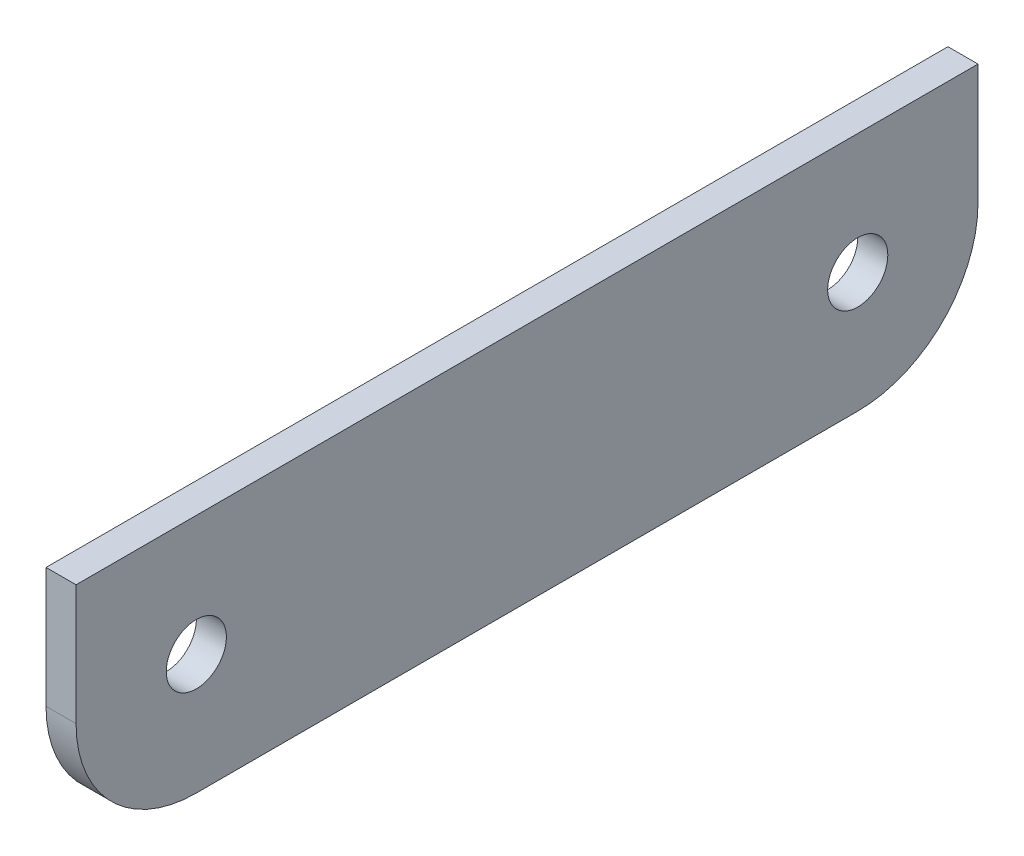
from build123d import *

# Parameters (mm, degrees)
ESQUISSE1_R        = 1
BOSS_EXTRU_1_DEPTH = 1


with BuildPart() as part:
    # Esquisse1 → Boss.-Extru.1 (new body)
    with BuildSketch(Plane(origin=(0, 0, 0), x_dir=(0, 0, -1), z_dir=(1, 0, 0))):
        with BuildLine():
            Line((0, 0), (30, 0))
            Line((30, 0), (30, -4))
            ThreePointArc((30, -4), (28.828427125, -6.828427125), (26, -8))
            Line((26, -8), (4, -8))
            ThreePointArc((4, -8), (1.171572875, -6.828427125), (0, -4))
            Line((0, -4), (0, 0))
        make_face()
        with Locations((26, -4)):
            Circle(ESQUISSE1_R, mode=Mode.SUBTRACT)
        with Locations(Location((4, -4, 0), (0, 0, 180))):
            Circle(ESQUISSE1_R, mode=Mode.SUBTRACT)
    extrude(amount=BOSS_EXTRU_1_DEPTH)


solid = part.part
